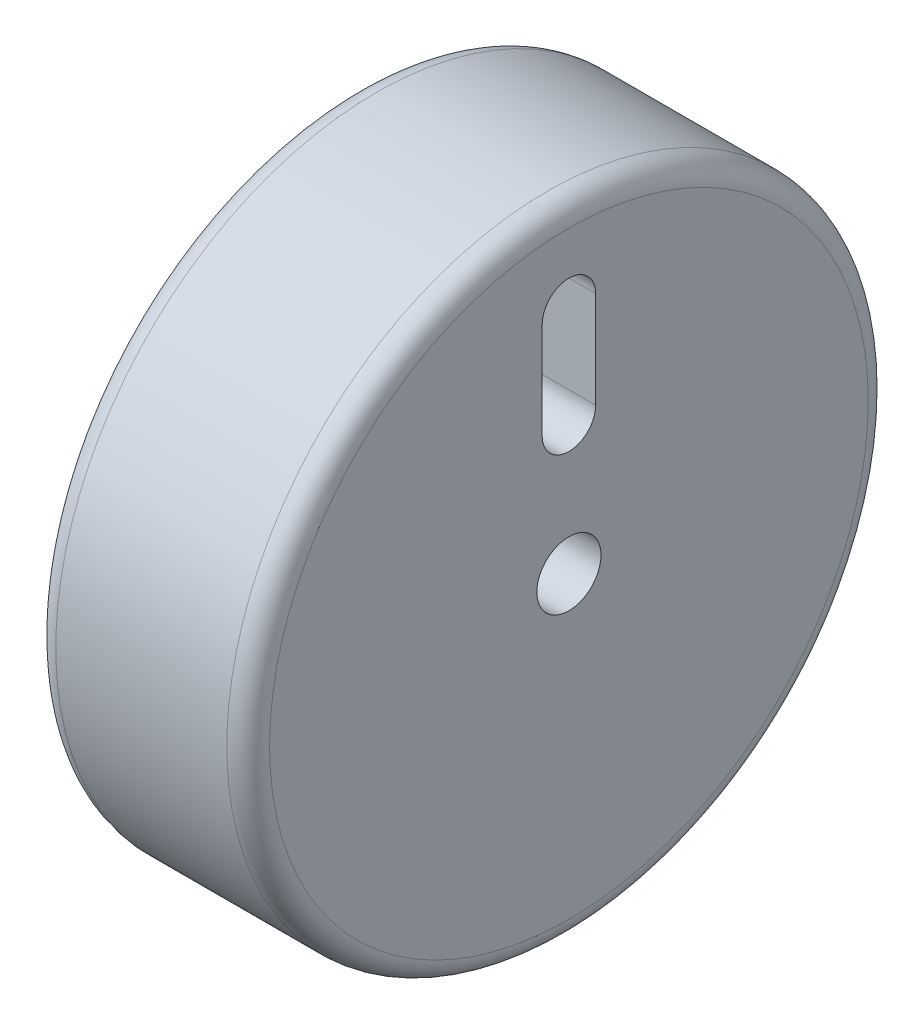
from build123d import *

# Parameters (mm, degrees)
SCHNITT_LINEAR_AUSTRAGEN1_DEPTH = 351.000000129


with BuildPart() as part:
    # Skizze1 → Rotation1 (revolve)
    with BuildSketch(Plane.XY, mode=Mode.PRIVATE) as rotation1_sk:
        with BuildLine():
            Line((-40, 300), (40, 300))
            ThreePointArc((40, 300), (47.071067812, 297.071067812), (50, 290))
            Line((50, 290), (50, 165))
            Line((50, 165), (-50, 165))
            Line((-50, 165), (-50, 290))
            ThreePointArc((-50, 290), (-47.071067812, 297.071067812), (-40, 300))
        make_face()
    revolve(rotation1_sk.sketch.rotate(Axis((0, 150, 0), (-1, 0, 0)), 90), axis=Axis((0, 150, 0), (-1, 0, 0)))

    # Skizze2 → Schnitt-Linear austragen1 (cut, through all)
    with BuildSketch(Plane(origin=(50, 0, 0), x_dir=(0, 0, -1), z_dir=(1, 0, 0))):
        with BuildLine():
            Line((-12.5, 212.00180895), (-12.5, 257.21710194))
            ThreePointArc((-12.5, 257.21710194), (0, 269.71710194), (12.5, 257.21710194))
            Line((12.5, 257.21710194), (12.5, 212.00180895))
            ThreePointArc((12.5, 212.00180895), (0, 199.50180895), (-12.5, 212.00180895))
        make_face()
    extrude(amount=-SCHNITT_LINEAR_AUSTRAGEN1_DEPTH, mode=Mode.SUBTRACT)


solid = part.part
